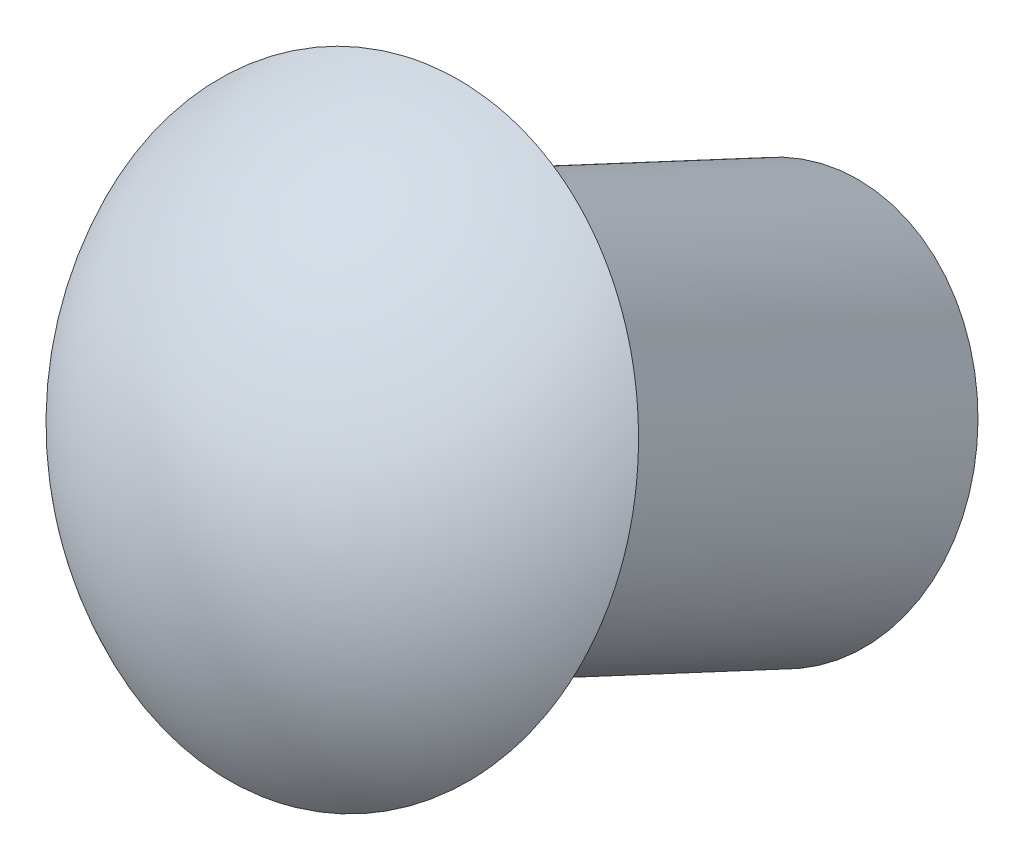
ISO-10303-21;
HEADER;
FILE_DESCRIPTION(('STEP AP214'),'2;1');
FILE_NAME('part.step','',(''),(''),'','','');
FILE_SCHEMA(('AUTOMOTIVE_DESIGN { 1 0 10303 214 1 1 1 1 }'));
ENDSEC;
DATA;
#1=APPLICATION_CONTEXT('core data for automotive mechanical design processes');
#2=APPLICATION_PROTOCOL_DEFINITION('international standard','automotive_design',2000,#1);
#3=PRODUCT_CONTEXT('',#1,'mechanical');
#4=PRODUCT('Part','Part','',(#3));
#5=PRODUCT_RELATED_PRODUCT_CATEGORY('part','',(#4));
#6=PRODUCT_DEFINITION_FORMATION('','',#4);
#7=PRODUCT_DEFINITION_CONTEXT('part definition',#1,'design');
#8=PRODUCT_DEFINITION('design','',#6,#7);
#9=PRODUCT_DEFINITION_SHAPE('','',#8);
#10=(LENGTH_UNIT() NAMED_UNIT(*) SI_UNIT(.MILLI.,.METRE.));
#11=(NAMED_UNIT(*) PLANE_ANGLE_UNIT() SI_UNIT($,.RADIAN.));
#12=(NAMED_UNIT(*) SI_UNIT($,.STERADIAN.) SOLID_ANGLE_UNIT());
#13=UNCERTAINTY_MEASURE_WITH_UNIT(LENGTH_MEASURE(1.E-05),#10,'distance_accuracy_value','');
#14=(GEOMETRIC_REPRESENTATION_CONTEXT(3) GLOBAL_UNCERTAINTY_ASSIGNED_CONTEXT((#13)) GLOBAL_UNIT_ASSIGNED_CONTEXT((#10,
#11,#12)) REPRESENTATION_CONTEXT('',''));
#15=CARTESIAN_POINT('',(0.,0.,0.));
#16=DIRECTION('',(0.,0.,1.));
#17=DIRECTION('',(1.,0.,0.));
#18=AXIS2_PLACEMENT_3D('',#15,#16,#17);
#19=CARTESIAN_POINT('',(-4.064,48.7073255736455,14.3605549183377));
#20=DIRECTION('',(0.,-0.422618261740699,-0.90630778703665));
#21=DIRECTION('',(0.,0.90630778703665,-0.422618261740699));
#22=AXIS2_PLACEMENT_3D('',#19,#20,#21);
#23=PLANE('',#22);
#24=CARTESIAN_POINT('',(-4.064,48.7073255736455,14.3605549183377));
#25=DIRECTION('',(0.,-0.422618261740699,-0.90630778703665));
#26=DIRECTION('',(0.,0.90630778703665,-0.422618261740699));
#27=AXIS2_PLACEMENT_3D('',#24,#25,#26);
#28=CIRCLE('',#27,1.190625);
#29=CARTESIAN_POINT('',(-4.064,49.786398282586,13.8573750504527));
#30=VERTEX_POINT('',#29);
#31=EDGE_CURVE('E22',#30,#30,#28,.F.);
#32=ORIENTED_EDGE('',*,*,#31,.F.);
#33=EDGE_LOOP('',(#32));
#34=FACE_BOUND('',#33,.T.);
#35=ADVANCED_FACE('F16',(#34),#23,.T.);
#36=CARTESIAN_POINT('',(-4.064,50.0491385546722,17.2380821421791));
#37=DIRECTION('',(0.,-0.422618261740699,-0.90630778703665));
#38=DIRECTION('',(0.,0.90630778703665,-0.422618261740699));
#39=AXIS2_PLACEMENT_3D('',#36,#37,#38);
#40=CYLINDRICAL_SURFACE('',#39,1.190625);
#41=ORIENTED_EDGE('',*,*,#31,.T.);
#42=EDGE_LOOP('',(#41));
#43=FACE_BOUND('',#42,.T.);
#44=CARTESIAN_POINT('',(-4.064,50.0491385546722,17.2380821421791));
#45=DIRECTION('',(0.,-0.422618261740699,-0.90630778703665));
#46=DIRECTION('',(0.,0.90630778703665,-0.422618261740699));
#47=AXIS2_PLACEMENT_3D('',#44,#45,#46);
#48=CIRCLE('',#47,1.190625);
#49=CARTESIAN_POINT('',(-4.064,51.1282112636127,16.7349022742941));
#50=VERTEX_POINT('',#49);
#51=EDGE_CURVE('E26',#50,#50,#48,.T.);
#52=ORIENTED_EDGE('',*,*,#51,.T.);
#53=EDGE_LOOP('',(#52));
#54=FACE_BOUND('',#53,.T.);
#55=ADVANCED_FACE('F37',(#43,#54),#40,.T.);
#56=CARTESIAN_POINT('',(-4.064,48.4311594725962,17.9925581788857));
#57=DIRECTION('',(0.,0.422618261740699,0.90630778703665));
#58=DIRECTION('',(0.,-0.90630778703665,0.422618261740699));
#59=AXIS2_PLACEMENT_3D('',#56,#57,#58);
#60=PLANE('',#59);
#61=CARTESIAN_POINT('',(-2.27875760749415,50.0491385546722,17.2380821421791));
#62=CARTESIAN_POINT('',(-2.27876205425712,50.140021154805,17.1957028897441));
#63=CARTESIAN_POINT('',(-2.28723493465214,50.2309696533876,17.1532929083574));
#64=CARTESIAN_POINT('',(-2.32091735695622,50.4103618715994,17.0696409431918));
#65=CARTESIAN_POINT('',(-2.34614704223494,50.4988024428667,17.0284004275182));
#66=CARTESIAN_POINT('',(-2.41262484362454,50.6705539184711,16.9483113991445));
#67=CARTESIAN_POINT('',(-2.45386530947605,50.7538672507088,16.9094617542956));
#68=CARTESIAN_POINT('',(-2.5511834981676,50.9130130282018,16.8352508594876));
#69=CARTESIAN_POINT('',(-2.60725753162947,50.9888473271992,16.7998887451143));
#70=CARTESIAN_POINT('',(-2.73266244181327,51.1309170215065,16.7336405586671));
#71=CARTESIAN_POINT('',(-2.80199470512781,51.1971514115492,16.702754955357));
#72=CARTESIAN_POINT('',(-2.95194725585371,51.3181331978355,16.6463402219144));
#73=CARTESIAN_POINT('',(-3.03256798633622,51.3728801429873,16.6208113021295));
#74=CARTESIAN_POINT('',(-3.20280511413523,51.4693289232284,16.5758364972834));
#75=CARTESIAN_POINT('',(-3.29242134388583,51.5110310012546,16.5563904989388));
#76=CARTESIAN_POINT('',(-3.47810660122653,51.5802075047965,16.5241329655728));
#77=CARTESIAN_POINT('',(-3.57417561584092,51.6076819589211,16.5113214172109));
#78=CARTESIAN_POINT('',(-3.77003967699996,51.6476234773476,16.4926963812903));
#79=CARTESIAN_POINT('',(-3.8698347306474,51.6600905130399,16.4868829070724));
#80=CARTESIAN_POINT('',(-4.0703176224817,51.6696631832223,16.4824190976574));
#81=CARTESIAN_POINT('',(-4.17100545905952,51.666768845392,16.483768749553));
#82=CARTESIAN_POINT('',(-4.37041590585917,51.6457009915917,16.4935928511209));
#83=CARTESIAN_POINT('',(-4.46913851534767,51.6275274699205,16.5020673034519));
#84=CARTESIAN_POINT('',(-4.6618161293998,51.5764171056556,16.5259004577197));
#85=CARTESIAN_POINT('',(-4.75577112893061,51.5434802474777,16.5412591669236));
#86=CARTESIAN_POINT('',(-4.93624627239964,51.4637782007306,16.5784248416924));
#87=CARTESIAN_POINT('',(-5.02276641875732,51.4170130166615,16.6002318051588));
#88=CARTESIAN_POINT('',(-5.18591580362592,51.3109818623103,16.6496749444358));
#89=CARTESIAN_POINT('',(-5.26254504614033,51.2517158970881,16.6773111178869));
#90=CARTESIAN_POINT('',(-5.40373739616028,51.1223655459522,16.7376281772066));
#91=CARTESIAN_POINT('',(-5.46830050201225,51.0522811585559,16.7703090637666));
#92=CARTESIAN_POINT('',(-5.58352781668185,50.9032834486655,16.839787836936));
#93=CARTESIAN_POINT('',(-5.63419202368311,50.8243701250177,16.8765857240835));
#94=CARTESIAN_POINT('',(-5.72018331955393,50.6599546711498,16.9532539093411));
#95=CARTESIAN_POINT('',(-5.75551040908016,50.574452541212,16.9931242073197));
#96=CARTESIAN_POINT('',(-5.80982463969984,50.3992866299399,17.0748054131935));
#97=CARTESIAN_POINT('',(-5.82881178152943,50.3096228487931,17.1166163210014));
#98=CARTESIAN_POINT('',(-5.84990713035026,50.1286789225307,17.2009918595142));
#99=CARTESIAN_POINT('',(-5.85201533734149,50.037398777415,17.2435564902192));
#100=CARTESIAN_POINT('',(-5.83929297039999,49.8558132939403,17.3282311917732));
#101=CARTESIAN_POINT('',(-5.82446239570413,49.7655079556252,17.3703412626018));
#102=CARTESIAN_POINT('',(-5.77828345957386,49.5884355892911,17.452911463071));
#103=CARTESIAN_POINT('',(-5.7469350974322,49.5016685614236,17.493371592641));
#104=CARTESIAN_POINT('',(-5.66861047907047,49.3341358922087,17.571493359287));
#105=CARTESIAN_POINT('',(-5.62163422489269,49.2533702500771,17.6091549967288));
#106=CARTESIAN_POINT('',(-5.5133873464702,49.1001330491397,17.6806106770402));
#107=CARTESIAN_POINT('',(-5.45211672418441,49.0276614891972,17.7144047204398));
#108=CARTESIAN_POINT('',(-5.3170203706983,48.8930696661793,17.7771659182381));
#109=CARTESIAN_POINT('',(-5.24319463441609,48.8309494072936,17.806133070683));
#110=CARTESIAN_POINT('',(-5.08508374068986,48.7188236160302,17.8584181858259));
#111=CARTESIAN_POINT('',(-5.00079857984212,48.6688180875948,17.8817361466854));
#112=CARTESIAN_POINT('',(-4.82416156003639,48.5823413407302,17.9220609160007));
#113=CARTESIAN_POINT('',(-4.73180970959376,48.5458701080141,17.9390677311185));
#114=CARTESIAN_POINT('',(-4.5416608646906,48.4874971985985,17.9662874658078));
#115=CARTESIAN_POINT('',(-4.44386387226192,48.4655955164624,17.9765003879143));
#116=CARTESIAN_POINT('',(-4.24560069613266,48.4369833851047,17.9898424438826));
#117=CARTESIAN_POINT('',(-4.14513450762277,48.4302729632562,17.99297156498));
#118=CARTESIAN_POINT('',(-3.94438524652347,48.4322339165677,17.9920571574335));
#119=CARTESIAN_POINT('',(-3.84410217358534,48.4409052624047,17.9880136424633));
#120=CARTESIAN_POINT('',(-3.64656548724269,48.4733835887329,17.9728687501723));
#121=CARTESIAN_POINT('',(-3.54931187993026,48.4971905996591,17.9617673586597));
#122=CARTESIAN_POINT('',(-3.36059332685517,48.5592649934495,17.9328215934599));
#123=CARTESIAN_POINT('',(-3.26912848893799,48.5975326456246,17.914977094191));
#124=CARTESIAN_POINT('',(-3.09458938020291,48.6874403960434,17.8730524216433));
#125=CARTESIAN_POINT('',(-3.0115147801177,48.7390799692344,17.8489724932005));
#126=CARTESIAN_POINT('',(-2.85611846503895,48.8542595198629,17.7952633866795));
#127=CARTESIAN_POINT('',(-2.78379562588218,48.9177982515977,17.7656347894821));
#128=CARTESIAN_POINT('',(-2.65192814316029,49.0549967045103,17.701658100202));
#129=CARTESIAN_POINT('',(-2.5923866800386,49.1286589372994,17.6673088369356));
#130=CARTESIAN_POINT('',(-2.48777173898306,49.2840261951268,17.5948598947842));
#131=CARTESIAN_POINT('',(-2.44270518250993,49.3657350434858,17.5567584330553));
#132=CARTESIAN_POINT('',(-2.36839950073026,49.5347860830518,17.4779286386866));
#133=CARTESIAN_POINT('',(-2.33914140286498,49.6221213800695,17.4372035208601));
#134=CARTESIAN_POINT('',(-2.30508110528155,49.766534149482,17.3698627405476));
#135=CARTESIAN_POINT('',(-2.29522211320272,49.8226732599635,17.3436846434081));
#136=CARTESIAN_POINT('',(-2.28205897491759,49.9355791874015,17.2910357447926));
#137=CARTESIAN_POINT('',(-2.27875482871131,49.9923460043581,17.2645649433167));
#138=CARTESIAN_POINT('',(-2.27875760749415,50.0491385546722,17.2380821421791));
#139=B_SPLINE_CURVE_WITH_KNOTS('',3,(#61,#62,#63,#64,#65,#66,#67,#68,#69,#70,#71,#72,#73,#74,
#75,#76,#77,#78,#79,#80,#81,#82,#83,#84,#85,#86,#87,#88,#89,#90,#91,#92,#93,#94,#95,#96,#97,#98,
#99,#100,#101,#102,#103,#104,#105,#106,#107,#108,#109,#110,#111,#112,#113,#114,#115,#116,#117,
#118,#119,#120,#121,#122,#123,#124,#125,#126,#127,#128,#129,#130,#131,#132,#133,#134,#135,#136,
#137,#138),.UNSPECIFIED.,.T.,.F.,(4,2,2,2,2,2,2,2,2,2,2,2,2,2,2,2,2,2,2,2,2,2,2,2,2,2,2,2,2,2,2,
2,2,2,2,2,2,2,4),(0.,0.300604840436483,0.601571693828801,0.902394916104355,1.20314338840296,
1.50392333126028,1.80471508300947,2.10550123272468,2.40628677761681,2.70707289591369,
3.00785847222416,3.30864416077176,3.60943016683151,3.91021607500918,4.21100186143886,
4.51178768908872,4.81257355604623,5.11335941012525,5.41414525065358,5.71493109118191,
6.01571694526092,6.31650281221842,6.61728863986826,6.91807442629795,7.21886033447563,
7.51964634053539,7.82043202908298,8.12121760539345,8.42200372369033,8.72278926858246,
9.02357541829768,9.32436717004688,9.6251471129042,9.9258955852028,10.2267188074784,
10.5276856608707,10.8282905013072,11.0161385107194,11.2039865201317),.UNSPECIFIED.);
#140=CARTESIAN_POINT('',(-2.27875760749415,50.0491385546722,17.2380821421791));
#141=VERTEX_POINT('',#140);
#142=EDGE_CURVE('E10',#141,#141,#139,.T.);
#143=ORIENTED_EDGE('',*,*,#142,.F.);
#144=EDGE_LOOP('',(#143));
#145=FACE_BOUND('',#144,.T.);
#146=ORIENTED_EDGE('',*,*,#51,.F.);
#147=EDGE_LOOP('',(#146));
#148=FACE_BOUND('',#147,.T.);
#149=ADVANCED_FACE('F32',(#145,#148),#60,.F.);
#150=CARTESIAN_POINT('',(-4.064,49.5553513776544,16.1791521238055));
#151=DIRECTION('',(0.582247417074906,0.624491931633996,0.520574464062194));
#152=DIRECTION('',(0.0607219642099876,-0.67191852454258,0.738131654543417));
#153=AXIS2_PLACEMENT_3D('',#150,#151,#152);
#154=SPHERICAL_SURFACE('',#153,2.1336);
#155=CARTESIAN_POINT('',(-2.82171691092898,50.8877673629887,17.2898498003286));
#156=VERTEX_POINT('',#155);
#157=VERTEX_LOOP('',#156);
#158=FACE_BOUND('',#157,.T.);
#159=ORIENTED_EDGE('',*,*,#142,.T.);
#160=EDGE_LOOP('',(#159));
#161=FACE_BOUND('',#160,.T.);
#162=ADVANCED_FACE('F18',(#158,#161),#154,.T.);
#163=CLOSED_SHELL('',(#35,#55,#149,#162));
#164=MANIFOLD_SOLID_BREP('B1',#163);
#165=ADVANCED_BREP_SHAPE_REPRESENTATION('',(#18,#164),#14);
#166=SHAPE_DEFINITION_REPRESENTATION(#9,#165);
ENDSEC;
END-ISO-10303-21;
